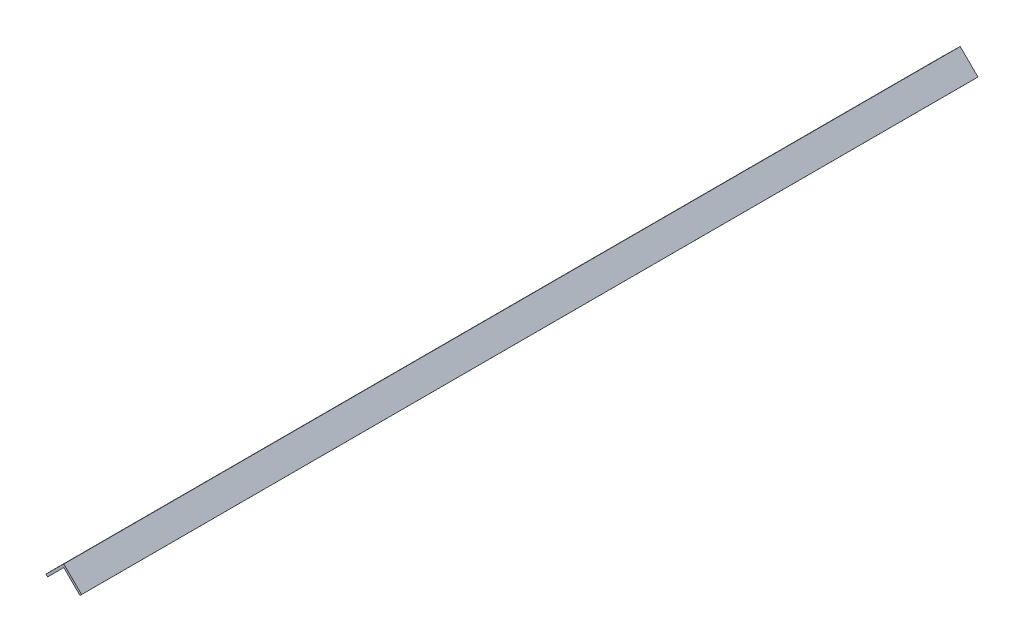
ISO-10303-21;
HEADER;
FILE_DESCRIPTION(('STEP AP214'),'2;1');
FILE_NAME('part.step','',(''),(''),'','','');
FILE_SCHEMA(('AUTOMOTIVE_DESIGN { 1 0 10303 214 1 1 1 1 }'));
ENDSEC;
DATA;
#1=APPLICATION_CONTEXT('core data for automotive mechanical design processes');
#2=APPLICATION_PROTOCOL_DEFINITION('international standard','automotive_design',2000,#1);
#3=PRODUCT_CONTEXT('',#1,'mechanical');
#4=PRODUCT('Part','Part','',(#3));
#5=PRODUCT_RELATED_PRODUCT_CATEGORY('part','',(#4));
#6=PRODUCT_DEFINITION_FORMATION('','',#4);
#7=PRODUCT_DEFINITION_CONTEXT('part definition',#1,'design');
#8=PRODUCT_DEFINITION('design','',#6,#7);
#9=PRODUCT_DEFINITION_SHAPE('','',#8);
#10=(LENGTH_UNIT() NAMED_UNIT(*) SI_UNIT(.MILLI.,.METRE.));
#11=(NAMED_UNIT(*) PLANE_ANGLE_UNIT() SI_UNIT($,.RADIAN.));
#12=(NAMED_UNIT(*) SI_UNIT($,.STERADIAN.) SOLID_ANGLE_UNIT());
#13=UNCERTAINTY_MEASURE_WITH_UNIT(LENGTH_MEASURE(1.E-05),#10,'distance_accuracy_value','');
#14=(GEOMETRIC_REPRESENTATION_CONTEXT(3) GLOBAL_UNCERTAINTY_ASSIGNED_CONTEXT((#13)) GLOBAL_UNIT_ASSIGNED_CONTEXT((#10,
#11,#12)) REPRESENTATION_CONTEXT('',''));
#15=CARTESIAN_POINT('',(0.,0.,0.));
#16=DIRECTION('',(0.,0.,1.));
#17=DIRECTION('',(1.,0.,0.));
#18=AXIS2_PLACEMENT_3D('',#15,#16,#17);
#19=CARTESIAN_POINT('',(0.,40.6688094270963,2260.));
#20=DIRECTION('',(0.707106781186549,0.707106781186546,0.));
#21=DIRECTION('',(-0.707106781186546,0.707106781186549,0.));
#22=AXIS2_PLACEMENT_3D('',#19,#20,#21);
#23=PLANE('',#22);
#24=DIRECTION('',(0.707106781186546,-0.707106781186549,0.));
#25=VECTOR('',#24,1.);
#26=CARTESIAN_POINT('',(0.,40.6688094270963,0.));
#27=LINE('',#26,#25);
#28=CARTESIAN_POINT('',(0.,40.6688094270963,0.));
#29=VERTEX_POINT('',#28);
#30=CARTESIAN_POINT('',(40.6688094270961,0.,0.));
#31=VERTEX_POINT('',#30);
#32=EDGE_CURVE('E117',#29,#31,#27,.T.);
#33=ORIENTED_EDGE('',*,*,#32,.T.);
#34=DIRECTION('',(0.,0.,-1.));
#35=VECTOR('',#34,1.);
#36=CARTESIAN_POINT('',(40.6688094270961,0.,2260.));
#37=LINE('',#36,#35);
#38=CARTESIAN_POINT('',(40.6688094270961,0.,2260.));
#39=VERTEX_POINT('',#38);
#40=EDGE_CURVE('E11',#39,#31,#37,.T.);
#41=ORIENTED_EDGE('',*,*,#40,.F.);
#42=DIRECTION('',(0.707106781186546,-0.707106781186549,0.));
#43=VECTOR('',#42,1.);
#44=CARTESIAN_POINT('',(0.,40.6688094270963,2260.));
#45=LINE('',#44,#43);
#46=CARTESIAN_POINT('',(0.,40.6688094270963,2260.));
#47=VERTEX_POINT('',#46);
#48=EDGE_CURVE('E82',#47,#39,#45,.T.);
#49=ORIENTED_EDGE('',*,*,#48,.F.);
#50=DIRECTION('',(0.,0.,-1.));
#51=VECTOR('',#50,1.);
#52=CARTESIAN_POINT('',(0.,40.6688094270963,2260.));
#53=LINE('',#52,#51);
#54=EDGE_CURVE('E116',#47,#29,#53,.T.);
#55=ORIENTED_EDGE('',*,*,#54,.T.);
#56=EDGE_LOOP('',(#33,#41,#49,#55));
#57=FACE_BOUND('',#56,.T.);
#58=ADVANCED_FACE('F33',(#57),#23,.F.);
#59=CARTESIAN_POINT('',(44.8796054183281,4.27424813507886,2260.));
#60=DIRECTION('',(0.712374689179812,-0.701799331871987,0.));
#61=DIRECTION('',(0.701799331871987,0.712374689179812,0.));
#62=AXIS2_PLACEMENT_3D('',#59,#60,#61);
#63=PLANE('',#62);
#64=DIRECTION('',(-0.701799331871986,-0.712374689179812,0.));
#65=VECTOR('',#64,1.);
#66=CARTESIAN_POINT('',(44.8796054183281,4.27424813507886,0.));
#67=LINE('',#66,#65);
#68=CARTESIAN_POINT('',(44.8796054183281,4.27424813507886,0.));
#69=VERTEX_POINT('',#68);
#70=EDGE_CURVE('E120',#69,#31,#67,.T.);
#71=ORIENTED_EDGE('',*,*,#70,.F.);
#72=DIRECTION('',(0.,0.,-1.));
#73=VECTOR('',#72,1.);
#74=CARTESIAN_POINT('',(44.8796054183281,4.27424813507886,2260.));
#75=LINE('',#74,#73);
#76=CARTESIAN_POINT('',(44.8796054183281,4.27424813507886,2260.));
#77=VERTEX_POINT('',#76);
#78=EDGE_CURVE('E41',#77,#69,#75,.T.);
#79=ORIENTED_EDGE('',*,*,#78,.F.);
#80=DIRECTION('',(-0.701799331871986,-0.712374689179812,0.));
#81=VECTOR('',#80,1.);
#82=CARTESIAN_POINT('',(44.8796054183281,4.27424813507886,2260.));
#83=LINE('',#82,#81);
#84=EDGE_CURVE('E111',#77,#39,#83,.T.);
#85=ORIENTED_EDGE('',*,*,#84,.T.);
#86=ORIENTED_EDGE('',*,*,#40,.T.);
#87=EDGE_LOOP('',(#71,#79,#85,#86));
#88=FACE_BOUND('',#87,.T.);
#89=ADVANCED_FACE('F137',(#88),#63,.T.);
#90=CARTESIAN_POINT('',(0.,48.4876060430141,2260.));
#91=DIRECTION('',(0.701799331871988,0.71237468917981,0.));
#92=DIRECTION('',(-0.71237468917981,0.701799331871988,0.));
#93=AXIS2_PLACEMENT_3D('',#90,#91,#92);
#94=PLANE('',#93);
#95=DIRECTION('',(0.71237468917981,-0.701799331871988,0.));
#96=VECTOR('',#95,1.);
#97=CARTESIAN_POINT('',(0.,48.4876060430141,0.));
#98=LINE('',#97,#96);
#99=CARTESIAN_POINT('',(0.,48.4876060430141,0.));
#100=VERTEX_POINT('',#99);
#101=EDGE_CURVE('E123',#100,#69,#98,.T.);
#102=ORIENTED_EDGE('',*,*,#101,.F.);
#103=DIRECTION('',(0.,0.,-1.));
#104=VECTOR('',#103,1.);
#105=CARTESIAN_POINT('',(0.,48.4876060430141,2260.));
#106=LINE('',#105,#104);
#107=CARTESIAN_POINT('',(0.,48.4876060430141,2260.));
#108=VERTEX_POINT('',#107);
#109=EDGE_CURVE('E100',#108,#100,#106,.T.);
#110=ORIENTED_EDGE('',*,*,#109,.F.);
#111=DIRECTION('',(0.71237468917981,-0.701799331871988,0.));
#112=VECTOR('',#111,1.);
#113=CARTESIAN_POINT('',(0.,48.4876060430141,2260.));
#114=LINE('',#113,#112);
#115=EDGE_CURVE('E109',#108,#77,#114,.T.);
#116=ORIENTED_EDGE('',*,*,#115,.T.);
#117=ORIENTED_EDGE('',*,*,#78,.T.);
#118=EDGE_LOOP('',(#102,#110,#116,#117));
#119=FACE_BOUND('',#118,.T.);
#120=ADVANCED_FACE('F134',(#119),#94,.T.);
#121=CARTESIAN_POINT('',(-44.879605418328,4.27424813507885,2260.));
#122=DIRECTION('',(-0.701799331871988,0.71237468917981,0.));
#123=DIRECTION('',(-0.71237468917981,-0.701799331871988,0.));
#124=AXIS2_PLACEMENT_3D('',#121,#122,#123);
#125=PLANE('',#124);
#126=DIRECTION('',(0.71237468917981,0.701799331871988,0.));
#127=VECTOR('',#126,1.);
#128=CARTESIAN_POINT('',(-44.879605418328,4.27424813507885,0.));
#129=LINE('',#128,#127);
#130=CARTESIAN_POINT('',(-44.879605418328,4.27424813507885,0.));
#131=VERTEX_POINT('',#130);
#132=EDGE_CURVE('E99',#131,#100,#129,.T.);
#133=ORIENTED_EDGE('',*,*,#132,.F.);
#134=DIRECTION('',(0.,0.,-1.));
#135=VECTOR('',#134,1.);
#136=CARTESIAN_POINT('',(-44.879605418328,4.27424813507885,2260.));
#137=LINE('',#136,#135);
#138=CARTESIAN_POINT('',(-44.879605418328,4.27424813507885,2260.));
#139=VERTEX_POINT('',#138);
#140=EDGE_CURVE('E93',#139,#131,#137,.T.);
#141=ORIENTED_EDGE('',*,*,#140,.F.);
#142=DIRECTION('',(0.71237468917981,0.701799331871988,0.));
#143=VECTOR('',#142,1.);
#144=CARTESIAN_POINT('',(-44.879605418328,4.27424813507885,2260.));
#145=LINE('',#144,#143);
#146=EDGE_CURVE('E97',#139,#108,#145,.T.);
#147=ORIENTED_EDGE('',*,*,#146,.T.);
#148=ORIENTED_EDGE('',*,*,#109,.T.);
#149=EDGE_LOOP('',(#133,#141,#147,#148));
#150=FACE_BOUND('',#149,.T.);
#151=ADVANCED_FACE('F95',(#150),#125,.T.);
#152=CARTESIAN_POINT('',(-44.879605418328,4.27424813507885,2260.));
#153=DIRECTION('',(0.71237468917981,0.701799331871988,0.));
#154=DIRECTION('',(-0.701799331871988,0.71237468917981,0.));
#155=AXIS2_PLACEMENT_3D('',#152,#153,#154);
#156=PLANE('',#155);
#157=DIRECTION('',(0.701799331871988,-0.71237468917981,0.));
#158=VECTOR('',#157,1.);
#159=CARTESIAN_POINT('',(-44.879605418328,4.27424813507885,0.));
#160=LINE('',#159,#158);
#161=CARTESIAN_POINT('',(-40.6688094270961,0.,0.));
#162=VERTEX_POINT('',#161);
#163=EDGE_CURVE('E70',#131,#162,#160,.T.);
#164=ORIENTED_EDGE('',*,*,#163,.T.);
#165=DIRECTION('',(0.,0.,-1.));
#166=VECTOR('',#165,1.);
#167=CARTESIAN_POINT('',(-40.6688094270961,0.,2260.));
#168=LINE('',#167,#166);
#169=CARTESIAN_POINT('',(-40.6688094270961,0.,2260.));
#170=VERTEX_POINT('',#169);
#171=EDGE_CURVE('E101',#170,#162,#168,.T.);
#172=ORIENTED_EDGE('',*,*,#171,.F.);
#173=DIRECTION('',(0.701799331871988,-0.71237468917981,0.));
#174=VECTOR('',#173,1.);
#175=CARTESIAN_POINT('',(-44.879605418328,4.27424813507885,2260.));
#176=LINE('',#175,#174);
#177=EDGE_CURVE('E103',#139,#170,#176,.T.);
#178=ORIENTED_EDGE('',*,*,#177,.F.);
#179=ORIENTED_EDGE('',*,*,#140,.T.);
#180=EDGE_LOOP('',(#164,#172,#178,#179));
#181=FACE_BOUND('',#180,.T.);
#182=ADVANCED_FACE('F104',(#181),#156,.F.);
#183=CARTESIAN_POINT('',(-40.6688094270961,0.,2260.));
#184=DIRECTION('',(-0.707106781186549,0.707106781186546,0.));
#185=DIRECTION('',(-0.707106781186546,-0.707106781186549,0.));
#186=AXIS2_PLACEMENT_3D('',#183,#184,#185);
#187=PLANE('',#186);
#188=DIRECTION('',(0.707106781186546,0.707106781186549,0.));
#189=VECTOR('',#188,1.);
#190=CARTESIAN_POINT('',(-40.6688094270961,0.,0.));
#191=LINE('',#190,#189);
#192=EDGE_CURVE('E76',#162,#29,#191,.T.);
#193=ORIENTED_EDGE('',*,*,#192,.T.);
#194=ORIENTED_EDGE('',*,*,#54,.F.);
#195=DIRECTION('',(0.707106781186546,0.707106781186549,0.));
#196=VECTOR('',#195,1.);
#197=CARTESIAN_POINT('',(-40.6688094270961,0.,2260.));
#198=LINE('',#197,#196);
#199=EDGE_CURVE('E49',#170,#47,#198,.T.);
#200=ORIENTED_EDGE('',*,*,#199,.F.);
#201=ORIENTED_EDGE('',*,*,#171,.T.);
#202=EDGE_LOOP('',(#193,#194,#200,#201));
#203=FACE_BOUND('',#202,.T.);
#204=ADVANCED_FACE('F142',(#203),#187,.F.);
#205=CARTESIAN_POINT('',(0.,0.,2260.));
#206=DIRECTION('',(0.,0.,1.));
#207=DIRECTION('',(1.,0.,0.));
#208=AXIS2_PLACEMENT_3D('',#205,#206,#207);
#209=PLANE('',#208);
#210=ORIENTED_EDGE('',*,*,#48,.T.);
#211=ORIENTED_EDGE('',*,*,#84,.F.);
#212=ORIENTED_EDGE('',*,*,#115,.F.);
#213=ORIENTED_EDGE('',*,*,#146,.F.);
#214=ORIENTED_EDGE('',*,*,#177,.T.);
#215=ORIENTED_EDGE('',*,*,#199,.T.);
#216=EDGE_LOOP('',(#210,#211,#212,#213,#214,#215));
#217=FACE_BOUND('',#216,.T.);
#218=ADVANCED_FACE('F107',(#217),#209,.T.);
#219=CARTESIAN_POINT('',(0.,0.,0.));
#220=DIRECTION('',(0.,0.,1.));
#221=DIRECTION('',(1.,0.,0.));
#222=AXIS2_PLACEMENT_3D('',#219,#220,#221);
#223=PLANE('',#222);
#224=ORIENTED_EDGE('',*,*,#32,.F.);
#225=ORIENTED_EDGE('',*,*,#192,.F.);
#226=ORIENTED_EDGE('',*,*,#163,.F.);
#227=ORIENTED_EDGE('',*,*,#132,.T.);
#228=ORIENTED_EDGE('',*,*,#101,.T.);
#229=ORIENTED_EDGE('',*,*,#70,.T.);
#230=EDGE_LOOP('',(#224,#225,#226,#227,#228,#229));
#231=FACE_BOUND('',#230,.T.);
#232=ADVANCED_FACE('F140',(#231),#223,.F.);
#233=CLOSED_SHELL('',(#58,#89,#120,#151,#182,#204,#218,#232));
#234=MANIFOLD_SOLID_BREP('B2',#233);
#235=ADVANCED_BREP_SHAPE_REPRESENTATION('',(#18,#234),#14);
#236=SHAPE_DEFINITION_REPRESENTATION(#9,#235);
ENDSEC;
END-ISO-10303-21;
